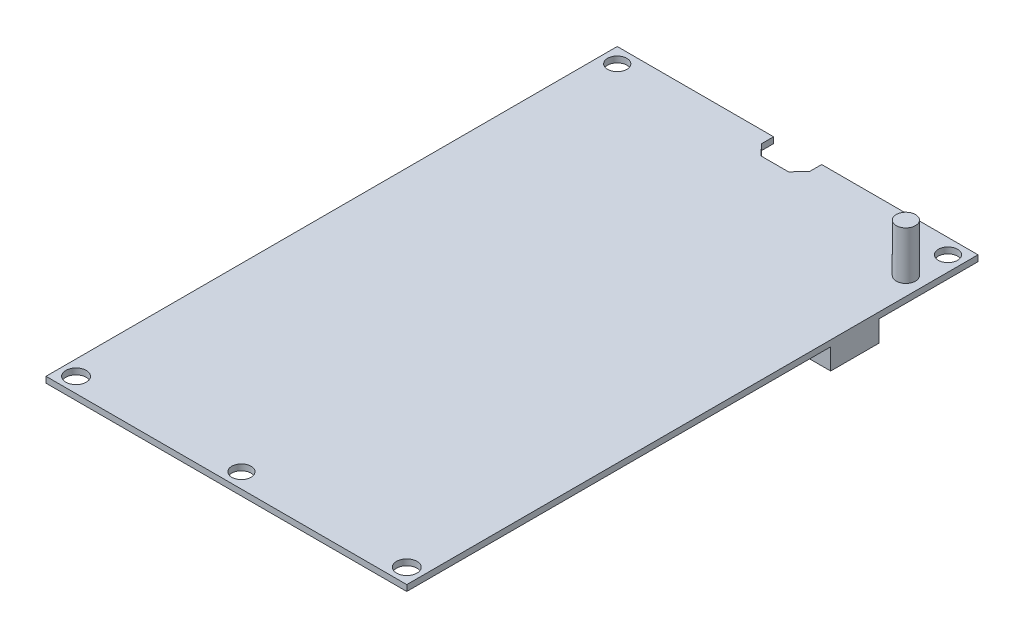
from build123d import *

# Parameters (mm, degrees)
SKETCH1_W           = 60
SKETCH1_H           = 95
BOSS_EXTRUDE1_DEPTH = 1
SKETCH4_R           = 1.6
CUT_EXTRUDE1_DEPTH  = 57.189411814
CUT_EXTRUDE2_DEPTH  = 57.189411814
SKETCH6_R           = 1.7
CUT_EXTRUDE3_DEPTH  = 1
SKETCH7_W           = 7
SKETCH7_H           = 8
BOSS_EXTRUDE2_DEPTH = 3.5
SKETCH8_R           = 1.6
BOSS_EXTRUDE3_DEPTH = 8
SKETCH9_W           = 9.5
SKETCH9_H           = 3.5
BOSS_EXTRUDE4_DEPTH = 2.5


with BuildPart() as part:
    # Sketch1 → Boss-Extrude1 (new body)
    with BuildSketch(Plane(origin=(0, 0, 0), x_dir=(1, 0, 0), z_dir=(0, 1, 0))):
        Rectangle(SKETCH1_W, SKETCH1_H)
    extrude(amount=BOSS_EXTRUDE1_DEPTH)

    # Sketch4 → Cut-Extrude1 (cut, through all)
    with BuildSketch(Plane(origin=(0, 1, 0), x_dir=(1, 0, 0), z_dir=(0, 1, 0))):
        with Locations(Location((-27.5, 45, 0), (0, 0, 270))):
            Circle(SKETCH4_R)
        with Locations(Location((27.5, 45, 0), (0, 0, 270))):
            Circle(SKETCH4_R)
        with Locations(Location((0, -45, 0), (0, 0, 270))):
            Circle(SKETCH4_R)
    extrude(amount=-CUT_EXTRUDE1_DEPTH, mode=Mode.SUBTRACT)

    # Sketch5 → Cut-Extrude2 (cut, through all)
    with BuildSketch(Plane(origin=(0, 1, 0), x_dir=(1, 0, 0), z_dir=(0, 1, 0))):
        Polygon((-4, 47.5), (-4, 45.5), (-2.3, 43.69), (2.3, 43.69), (4, 45.5), (4, 47.5), align=None)
    extrude(amount=-CUT_EXTRUDE2_DEPTH, mode=Mode.SUBTRACT)

    # Sketch6 → Cut-Extrude3 (cut)
    with BuildSketch(Plane(origin=(0, 1, 0), x_dir=(1, 0, 0), z_dir=(0, 1, 0))):
        with Locations(Location((-27.5, -45, 0), (0, 0, 270))):
            Circle(SKETCH6_R)
        with Locations(Location((27.5, -45, 0), (0, 0, 270))):
            Circle(SKETCH6_R)
    extrude(amount=-CUT_EXTRUDE3_DEPTH, mode=Mode.SUBTRACT)

    # Sketch7 → Boss-Extrude2 (add)
    with BuildSketch(Plane.XZ):
        with Locations((26.5, -27)):
            Rectangle(SKETCH7_W, SKETCH7_H)
    extrude(amount=BOSS_EXTRUDE2_DEPTH)

    # Sketch8 → Boss-Extrude3 (add)
    with BuildSketch(Plane(origin=(0, 1, 0), x_dir=(1, 0, 0), z_dir=(0, 1, 0))):
        with Locations(Location((27, 38.5, 0), (0, 0, 90))):
            Circle(SKETCH8_R)
    extrude(amount=BOSS_EXTRUDE3_DEPTH)

    # Sketch9 → Boss-Extrude4 (add)
    with BuildSketch(Plane.XZ):
        with Locations((10.25, -45.75)):
            Rectangle(SKETCH9_W, SKETCH9_H)
    extrude(amount=BOSS_EXTRUDE4_DEPTH)


solid = part.part
